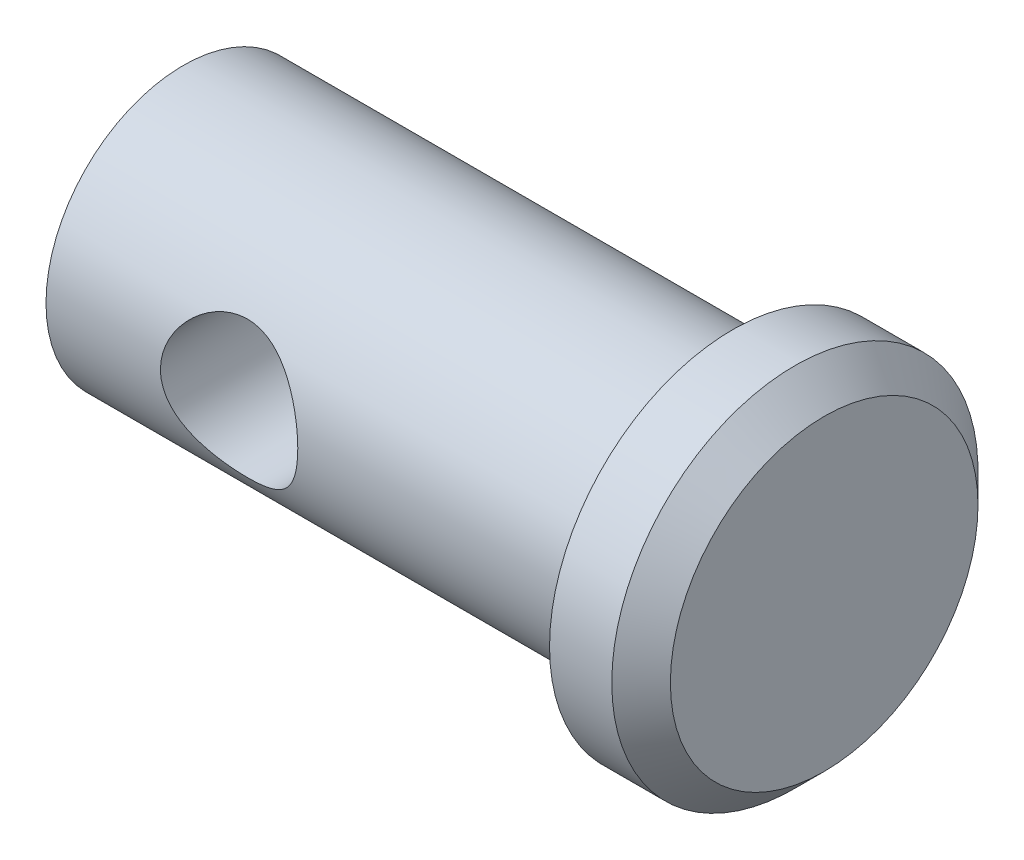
from build123d import *

# Parameters (mm, degrees)
CHAMFER1_SIZE           = 0.508
CUT_EXTRUDE1_DEPTH      = 12.985362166
CUT_EXTRUDE1_DEPTH_BACK = 12.985362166
SKETCH2_R               = 1.190625


with BuildPart() as part:
    # Sketch1 → Revolve1 (revolve)
    with BuildSketch(Plane.XY, mode=Mode.PRIVATE) as revolve1_sk:
        Polygon((0, 0), (0, 2.38125), (9.525, 2.38125), (9.525, 3.175), (11.1125, 3.175), (11.1125, 0), align=None)
    revolve(revolve1_sk.sketch.rotate(Axis((0, 0, 0), (1, 0, 0)), 90), axis=Axis((0, 0, 0), (1, 0, 0)))

    # Chamfer1
    chamfer1_edges = [part.edges().sort_by_distance(p)[0] for p in [
        (11.1125, 0, -3.175),
    ]]
    chamfer(chamfer1_edges, length=CHAMFER1_SIZE)

    # Sketch2 → Cut-Extrude1 (cut, two sides: drawn at the far end of the back side and taken through both)
    with BuildSketch(Plane.XY.offset(-CUT_EXTRUDE1_DEPTH_BACK)):
        with Locations((3.175, 0)):
            Circle(SKETCH2_R)
    extrude(amount=CUT_EXTRUDE1_DEPTH + CUT_EXTRUDE1_DEPTH_BACK, mode=Mode.SUBTRACT)


solid = part.part
